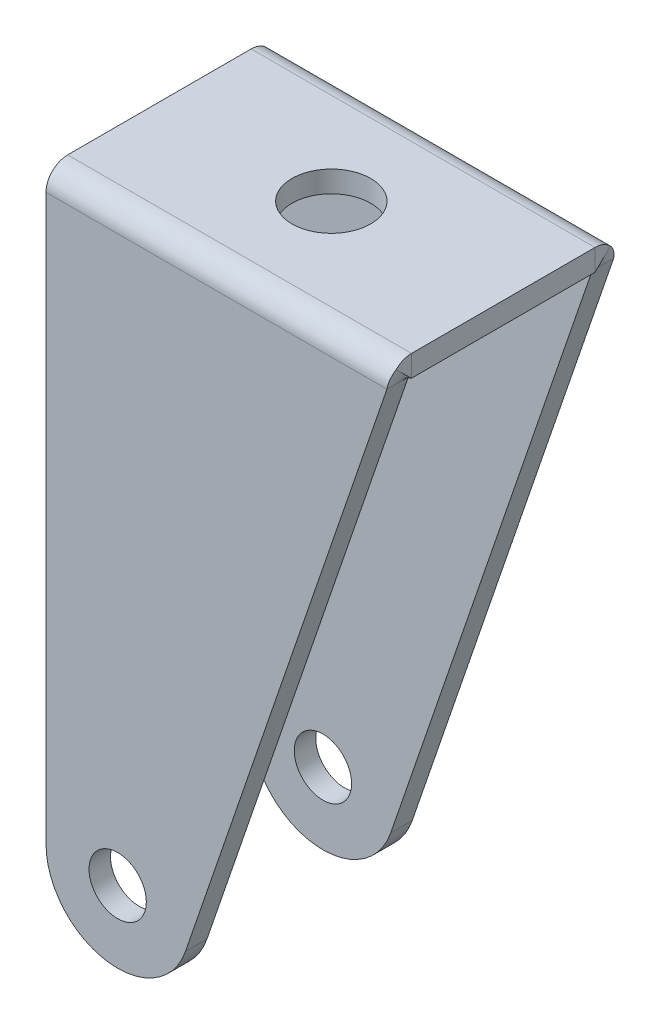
ISO-10303-21;
HEADER;
FILE_DESCRIPTION(('STEP AP214'),'2;1');
FILE_NAME('part.step','',(''),(''),'','','');
FILE_SCHEMA(('AUTOMOTIVE_DESIGN { 1 0 10303 214 1 1 1 1 }'));
ENDSEC;
DATA;
#1=APPLICATION_CONTEXT('core data for automotive mechanical design processes');
#2=APPLICATION_PROTOCOL_DEFINITION('international standard','automotive_design',2000,#1);
#3=PRODUCT_CONTEXT('',#1,'mechanical');
#4=PRODUCT('Part','Part','',(#3));
#5=PRODUCT_RELATED_PRODUCT_CATEGORY('part','',(#4));
#6=PRODUCT_DEFINITION_FORMATION('','',#4);
#7=PRODUCT_DEFINITION_CONTEXT('part definition',#1,'design');
#8=PRODUCT_DEFINITION('design','',#6,#7);
#9=PRODUCT_DEFINITION_SHAPE('','',#8);
#10=(LENGTH_UNIT() NAMED_UNIT(*) SI_UNIT(.MILLI.,.METRE.));
#11=(NAMED_UNIT(*) PLANE_ANGLE_UNIT() SI_UNIT($,.RADIAN.));
#12=(NAMED_UNIT(*) SI_UNIT($,.STERADIAN.) SOLID_ANGLE_UNIT());
#13=UNCERTAINTY_MEASURE_WITH_UNIT(LENGTH_MEASURE(1.E-05),#10,'distance_accuracy_value','');
#14=(GEOMETRIC_REPRESENTATION_CONTEXT(3) GLOBAL_UNCERTAINTY_ASSIGNED_CONTEXT((#13)) GLOBAL_UNIT_ASSIGNED_CONTEXT((#10,
#11,#12)) REPRESENTATION_CONTEXT('',''));
#15=CARTESIAN_POINT('',(0.,0.,0.));
#16=DIRECTION('',(0.,0.,1.));
#17=DIRECTION('',(1.,0.,0.));
#18=AXIS2_PLACEMENT_3D('',#15,#16,#17);
#19=CARTESIAN_POINT('',(5.,1.5,-48.0002960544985));
#20=DIRECTION('',(0.,1.,0.));
#21=DIRECTION('',(0.,0.,1.));
#22=AXIS2_PLACEMENT_3D('',#19,#20,#21);
#23=PLANE('',#22);
#24=CARTESIAN_POINT('',(12.,1.5,-1.));
#25=DIRECTION('',(0.,1.,0.));
#26=DIRECTION('',(0.,0.,1.));
#27=AXIS2_PLACEMENT_3D('',#24,#25,#26);
#28=CIRCLE('',#27,2.75);
#29=CARTESIAN_POINT('',(12.,1.5,1.75));
#30=VERTEX_POINT('',#29);
#31=EDGE_CURVE('E370',#30,#30,#28,.T.);
#32=ORIENTED_EDGE('',*,*,#31,.F.);
#33=EDGE_LOOP('',(#32));
#34=FACE_BOUND('',#33,.T.);
#35=DIRECTION('',(0.,0.,1.));
#36=VECTOR('',#35,1.);
#37=CARTESIAN_POINT('',(0.,1.5,-48.0002960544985));
#38=LINE('',#37,#36);
#39=CARTESIAN_POINT('',(0.,1.5,-7.40314292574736));
#40=VERTEX_POINT('',#39);
#41=CARTESIAN_POINT('',(0.,1.5,5.40305186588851));
#42=VERTEX_POINT('',#41);
#43=EDGE_CURVE('E364',#40,#42,#38,.T.);
#44=ORIENTED_EDGE('',*,*,#43,.T.);
#45=DIRECTION('',(1.,0.,0.));
#46=VECTOR('',#45,1.);
#47=CARTESIAN_POINT('',(5.,1.5,5.40305186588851));
#48=LINE('',#47,#46);
#49=CARTESIAN_POINT('',(23.9990036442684,1.5,5.40305186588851));
#50=VERTEX_POINT('',#49);
#51=EDGE_CURVE('E354',#42,#50,#48,.T.);
#52=ORIENTED_EDGE('',*,*,#51,.T.);
#53=DIRECTION('',(0.,0.,-1.));
#54=VECTOR('',#53,1.);
#55=CARTESIAN_POINT('',(23.9990036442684,1.5,-8.00004552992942));
#56=LINE('',#55,#54);
#57=CARTESIAN_POINT('',(23.9990036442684,1.5,-7.40314292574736));
#58=VERTEX_POINT('',#57);
#59=EDGE_CURVE('E365',#50,#58,#56,.T.);
#60=ORIENTED_EDGE('',*,*,#59,.T.);
#61=DIRECTION('',(1.,0.,0.));
#62=VECTOR('',#61,1.);
#63=CARTESIAN_POINT('',(5.,1.5,-7.40314292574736));
#64=LINE('',#63,#62);
#65=EDGE_CURVE('E368',#40,#58,#64,.T.);
#66=ORIENTED_EDGE('',*,*,#65,.F.);
#67=EDGE_LOOP('',(#44,#52,#60,#66));
#68=FACE_BOUND('',#67,.T.);
#69=ADVANCED_FACE('F54',(#34,#68),#23,.T.);
#70=CARTESIAN_POINT('',(23.9990036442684,1.5,-8.00004552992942));
#71=DIRECTION('',(-1.,0.,0.));
#72=DIRECTION('',(0.,0.,1.));
#73=AXIS2_PLACEMENT_3D('',#70,#71,#72);
#74=PLANE('',#73);
#75=DIRECTION('',(0.,1.,0.));
#76=VECTOR('',#75,1.);
#77=CARTESIAN_POINT('',(23.9990036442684,1.5,5.40305186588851));
#78=LINE('',#77,#76);
#79=CARTESIAN_POINT('',(23.9990036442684,0.,5.40305186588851));
#80=VERTEX_POINT('',#79);
#81=EDGE_CURVE('E12',#80,#50,#78,.T.);
#82=ORIENTED_EDGE('',*,*,#81,.F.);
#83=DIRECTION('',(0.,0.,-1.));
#84=VECTOR('',#83,1.);
#85=CARTESIAN_POINT('',(23.9990036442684,0.,-8.00004552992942));
#86=LINE('',#85,#84);
#87=CARTESIAN_POINT('',(23.9990036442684,0.,-7.40314292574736));
#88=VERTEX_POINT('',#87);
#89=EDGE_CURVE('E73',#80,#88,#86,.T.);
#90=ORIENTED_EDGE('',*,*,#89,.T.);
#91=DIRECTION('',(0.,1.,0.));
#92=VECTOR('',#91,1.);
#93=CARTESIAN_POINT('',(23.9990036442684,1.5,-7.40314292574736));
#94=LINE('',#93,#92);
#95=EDGE_CURVE('E439',#88,#58,#94,.T.);
#96=ORIENTED_EDGE('',*,*,#95,.T.);
#97=ORIENTED_EDGE('',*,*,#59,.F.);
#98=EDGE_LOOP('',(#82,#90,#96,#97));
#99=FACE_BOUND('',#98,.T.);
#100=ADVANCED_FACE('F415',(#99),#74,.F.);
#101=CARTESIAN_POINT('',(0.,1.5,-48.0002960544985));
#102=DIRECTION('',(1.,0.,0.));
#103=DIRECTION('',(0.,0.,-1.));
#104=AXIS2_PLACEMENT_3D('',#101,#102,#103);
#105=PLANE('',#104);
#106=DIRECTION('',(0.,-1.,0.));
#107=VECTOR('',#106,1.);
#108=CARTESIAN_POINT('',(0.,1.5,5.40305186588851));
#109=LINE('',#108,#107);
#110=CARTESIAN_POINT('',(0.,0.,5.40305186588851));
#111=VERTEX_POINT('',#110);
#112=EDGE_CURVE('E357',#42,#111,#109,.T.);
#113=ORIENTED_EDGE('',*,*,#112,.F.);
#114=ORIENTED_EDGE('',*,*,#43,.F.);
#115=DIRECTION('',(0.,-1.,0.));
#116=VECTOR('',#115,1.);
#117=CARTESIAN_POINT('',(0.,1.5,-7.40314292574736));
#118=LINE('',#117,#116);
#119=CARTESIAN_POINT('',(0.,0.,-7.40314292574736));
#120=VERTEX_POINT('',#119);
#121=EDGE_CURVE('E358',#40,#120,#118,.T.);
#122=ORIENTED_EDGE('',*,*,#121,.T.);
#123=DIRECTION('',(0.,0.,1.));
#124=VECTOR('',#123,1.);
#125=CARTESIAN_POINT('',(0.,0.,-48.0002960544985));
#126=LINE('',#125,#124);
#127=EDGE_CURVE('E81',#120,#111,#126,.T.);
#128=ORIENTED_EDGE('',*,*,#127,.T.);
#129=EDGE_LOOP('',(#113,#114,#122,#128));
#130=FACE_BOUND('',#129,.T.);
#131=ADVANCED_FACE('F421',(#130),#105,.F.);
#132=CARTESIAN_POINT('',(5.,0.,-48.0002960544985));
#133=DIRECTION('',(0.,1.,0.));
#134=DIRECTION('',(0.,0.,1.));
#135=AXIS2_PLACEMENT_3D('',#132,#133,#134);
#136=PLANE('',#135);
#137=DIRECTION('',(1.,0.,0.));
#138=VECTOR('',#137,1.);
#139=CARTESIAN_POINT('',(5.,0.,5.40305186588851));
#140=LINE('',#139,#138);
#141=EDGE_CURVE('E65',#111,#80,#140,.T.);
#142=ORIENTED_EDGE('',*,*,#141,.F.);
#143=ORIENTED_EDGE('',*,*,#127,.F.);
#144=DIRECTION('',(1.,0.,0.));
#145=VECTOR('',#144,1.);
#146=CARTESIAN_POINT('',(5.,0.,-7.40314292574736));
#147=LINE('',#146,#145);
#148=EDGE_CURVE('E441',#120,#88,#147,.T.);
#149=ORIENTED_EDGE('',*,*,#148,.T.);
#150=ORIENTED_EDGE('',*,*,#89,.F.);
#151=EDGE_LOOP('',(#142,#143,#149,#150));
#152=FACE_BOUND('',#151,.T.);
#153=CARTESIAN_POINT('',(12.,0.,-1.));
#154=DIRECTION('',(0.,1.,0.));
#155=DIRECTION('',(0.,0.,1.));
#156=AXIS2_PLACEMENT_3D('',#153,#154,#155);
#157=CIRCLE('',#156,2.75);
#158=CARTESIAN_POINT('',(12.,0.,1.75));
#159=VERTEX_POINT('',#158);
#160=EDGE_CURVE('E444',#159,#159,#157,.T.);
#161=ORIENTED_EDGE('',*,*,#160,.T.);
#162=EDGE_LOOP('',(#161));
#163=FACE_BOUND('',#162,.T.);
#164=ADVANCED_FACE('F56',(#152,#163),#136,.F.);
#165=CARTESIAN_POINT('',(12.,1.5,-1.));
#166=DIRECTION('',(0.,-1.,0.));
#167=DIRECTION('',(0.,0.,-1.));
#168=AXIS2_PLACEMENT_3D('',#165,#166,#167);
#169=CYLINDRICAL_SURFACE('',#168,2.75);
#170=ORIENTED_EDGE('',*,*,#31,.T.);
#171=EDGE_LOOP('',(#170));
#172=FACE_BOUND('',#171,.T.);
#173=ORIENTED_EDGE('',*,*,#160,.F.);
#174=EDGE_LOOP('',(#173));
#175=FACE_BOUND('',#174,.T.);
#176=ADVANCED_FACE('F431',(#172,#175),#169,.F.);
#177=CARTESIAN_POINT('',(0.,-0.01,-7.40314292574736));
#178=DIRECTION('',(-1.,0.,0.));
#179=DIRECTION('',(0.,0.,1.));
#180=AXIS2_PLACEMENT_3D('',#177,#178,#179);
#181=PLANE('',#180);
#182=DIRECTION('',(0.,0.,1.));
#183=VECTOR('',#182,1.);
#184=CARTESIAN_POINT('',(0.,-0.0100000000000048,-8.91314292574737));
#185=LINE('',#184,#183);
#186=CARTESIAN_POINT('',(0.,-0.010000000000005,-8.91314292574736));
#187=VERTEX_POINT('',#186);
#188=CARTESIAN_POINT('',(0.,-0.00999999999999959,-7.41314292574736));
#189=VERTEX_POINT('',#188);
#190=EDGE_CURVE('E345',#187,#189,#185,.T.);
#191=ORIENTED_EDGE('',*,*,#190,.T.);
#192=CARTESIAN_POINT('',(0.,-0.01,-7.40314292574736));
#193=DIRECTION('',(-1.,0.,0.));
#194=DIRECTION('',(0.,0.,1.));
#195=AXIS2_PLACEMENT_3D('',#192,#193,#194);
#196=CIRCLE('',#195,0.01);
#197=EDGE_CURVE('E482',#189,#120,#196,.F.);
#198=ORIENTED_EDGE('',*,*,#197,.T.);
#199=ORIENTED_EDGE('',*,*,#121,.F.);
#200=CARTESIAN_POINT('',(0.,-0.01,-7.40314292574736));
#201=DIRECTION('',(1.,0.,0.));
#202=DIRECTION('',(0.,0.,-1.));
#203=AXIS2_PLACEMENT_3D('',#200,#201,#202);
#204=CIRCLE('',#203,1.51);
#205=EDGE_CURVE('E478',#187,#40,#204,.T.);
#206=ORIENTED_EDGE('',*,*,#205,.F.);
#207=EDGE_LOOP('',(#191,#198,#199,#206));
#208=FACE_BOUND('',#207,.T.);
#209=ADVANCED_FACE('F545',(#208),#181,.T.);
#210=CARTESIAN_POINT('',(23.9990036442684,-0.01,-7.40314292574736));
#211=DIRECTION('',(1.,0.,0.));
#212=DIRECTION('',(0.,0.,-1.));
#213=AXIS2_PLACEMENT_3D('',#210,#211,#212);
#214=PLANE('',#213);
#215=ORIENTED_EDGE('',*,*,#95,.F.);
#216=CARTESIAN_POINT('',(23.9990036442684,-0.01,-7.40314292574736));
#217=DIRECTION('',(-1.,0.,0.));
#218=DIRECTION('',(0.,0.,1.));
#219=AXIS2_PLACEMENT_3D('',#216,#217,#218);
#220=CIRCLE('',#219,0.01);
#221=CARTESIAN_POINT('',(23.9990036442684,-0.00292893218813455,-7.41021399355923));
#222=VERTEX_POINT('',#221);
#223=EDGE_CURVE('E484',#88,#222,#220,.T.);
#224=ORIENTED_EDGE('',*,*,#223,.T.);
#225=CARTESIAN_POINT('',(23.9990036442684,1.05773123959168,-8.47087416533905));
#226=CARTESIAN_POINT('',(23.9990036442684,-0.00292893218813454,-7.41021399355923));
#227=B_SPLINE_CURVE_WITH_KNOTS('',1,(#225,#226),.UNSPECIFIED.,.F.,.F.,(2,2),(0.,1.),.UNSPECIFIED.);
#228=CARTESIAN_POINT('',(23.9990036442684,1.05773123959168,-8.47087416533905));
#229=VERTEX_POINT('',#228);
#230=EDGE_CURVE('E569',#222,#229,#227,.F.);
#231=ORIENTED_EDGE('',*,*,#230,.T.);
#232=CARTESIAN_POINT('',(23.9990036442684,-0.01,-7.40314292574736));
#233=DIRECTION('',(-1.,0.,0.));
#234=DIRECTION('',(0.,0.,1.));
#235=AXIS2_PLACEMENT_3D('',#232,#233,#234);
#236=CIRCLE('',#235,1.51);
#237=EDGE_CURVE('E480',#58,#229,#236,.T.);
#238=ORIENTED_EDGE('',*,*,#237,.F.);
#239=EDGE_LOOP('',(#215,#224,#231,#238));
#240=FACE_BOUND('',#239,.T.);
#241=ADVANCED_FACE('F501',(#240),#214,.T.);
#242=CARTESIAN_POINT('',(23.9990036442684,1.05773123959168,-8.47087416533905));
#243=CARTESIAN_POINT('',(23.9648915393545,0.917941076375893,-8.61066432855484));
#244=CARTESIAN_POINT('',(23.9307913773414,0.750464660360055,-8.72256037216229));
#245=CARTESIAN_POINT('',(23.8625791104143,0.385239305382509,-8.87384166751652));
#246=CARTESIAN_POINT('',(23.8284789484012,0.187693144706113,-8.91314292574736));
#247=CARTESIAN_POINT('',(23.7943668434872,-0.0100000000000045,-8.91314292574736));
#248=CARTESIAN_POINT('',(23.9990036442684,-0.00292893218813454,-7.41021399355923));
#249=CARTESIAN_POINT('',(23.9648975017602,-0.00385453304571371,-7.41113959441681));
#250=CARTESIAN_POINT('',(23.9307913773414,-0.00496381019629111,-7.4118807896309));
#251=CARTESIAN_POINT('',(23.8625791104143,-0.00738252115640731,-7.41288265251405));
#252=CARTESIAN_POINT('',(23.8284729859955,-0.00869100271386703,-7.41314292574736));
#253=CARTESIAN_POINT('',(23.7943668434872,-0.0100000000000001,-7.41314292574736));
#254=B_SPLINE_SURFACE_WITH_KNOTS('',1,3,((#242,#243,#244,#245,#246,#247),(#248,#249,#250,#251,
#252,#253)),.UNSPECIFIED.,.F.,.F.,.F.,(2,2),(4,2,4),(0.,1.),(0.,0.5,1.),.UNSPECIFIED.);
#255=CARTESIAN_POINT('',(23.9990036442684,-0.00292893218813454,-7.41021399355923));
#256=CARTESIAN_POINT('',(23.9648975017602,-0.00385453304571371,-7.41113959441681));
#257=CARTESIAN_POINT('',(23.9307913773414,-0.00496381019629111,-7.4118807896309));
#258=CARTESIAN_POINT('',(23.8625791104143,-0.00738252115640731,-7.41288265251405));
#259=CARTESIAN_POINT('',(23.8284729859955,-0.00869100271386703,-7.41314292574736));
#260=CARTESIAN_POINT('',(23.7943668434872,-0.0100000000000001,-7.41314292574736));
#261=B_SPLINE_CURVE_WITH_KNOTS('',3,(#255,#256,#257,#258,#259,#260),.UNSPECIFIED.,.F.,.F.,(4,2,
4),(0.,0.5,1.),.UNSPECIFIED.);
#262=CARTESIAN_POINT('',(23.7943668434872,-0.00999999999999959,-7.41314292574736));
#263=VERTEX_POINT('',#262);
#264=EDGE_CURVE('E481',#222,#263,#261,.T.);
#265=CARTESIAN_POINT('',(23.7943668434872,-0.0100000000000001,-7.41314292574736));
#266=CARTESIAN_POINT('',(23.7943668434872,-0.0100000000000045,-8.91314292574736));
#267=B_SPLINE_CURVE_WITH_KNOTS('',1,(#265,#266),.UNSPECIFIED.,.F.,.F.,(2,2),(0.,1.),.UNSPECIFIED.);
#268=CARTESIAN_POINT('',(23.7943668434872,-0.0100000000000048,-8.91314292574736));
#269=VERTEX_POINT('',#268);
#270=EDGE_CURVE('E344',#263,#269,#267,.T.);
#271=CARTESIAN_POINT('',(23.7943668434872,-0.0100000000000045,-8.91314292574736));
#272=CARTESIAN_POINT('',(23.8284789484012,0.187693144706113,-8.91314292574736));
#273=CARTESIAN_POINT('',(23.8625791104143,0.385239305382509,-8.87384166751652));
#274=CARTESIAN_POINT('',(23.9307913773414,0.750464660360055,-8.72256037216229));
#275=CARTESIAN_POINT('',(23.9648915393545,0.917941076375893,-8.61066432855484));
#276=CARTESIAN_POINT('',(23.9990036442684,1.05773123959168,-8.47087416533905));
#277=B_SPLINE_CURVE_WITH_KNOTS('',3,(#271,#272,#273,#274,#275,#276),.UNSPECIFIED.,.F.,.F.,(4,2,
4),(0.,0.5,1.),.UNSPECIFIED.);
#278=EDGE_CURVE('E529',#229,#269,#277,.F.);
#279=ORIENTED_EDGE('',*,*,#264,.T.);
#280=ORIENTED_EDGE('',*,*,#270,.T.);
#281=ORIENTED_EDGE('',*,*,#278,.F.);
#282=ORIENTED_EDGE('',*,*,#230,.F.);
#283=EDGE_LOOP('',(#279,#280,#281,#282));
#284=FACE_BOUND('',#283,.T.);
#285=ADVANCED_FACE('F500',(#284),#254,.T.);
#286=CARTESIAN_POINT('',(36.0749529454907,-0.01,-7.40314292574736));
#287=DIRECTION('',(-1.,0.,0.));
#288=DIRECTION('',(0.,0.,1.));
#289=AXIS2_PLACEMENT_3D('',#286,#287,#288);
#290=CYLINDRICAL_SURFACE('',#289,1.51);
#291=ORIENTED_EDGE('',*,*,#237,.T.);
#292=ORIENTED_EDGE('',*,*,#278,.T.);
#293=DIRECTION('',(1.,0.,0.));
#294=VECTOR('',#293,1.);
#295=CARTESIAN_POINT('',(5.,-0.0100000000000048,-8.91314292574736));
#296=LINE('',#295,#294);
#297=EDGE_CURVE('E449',#187,#269,#296,.T.);
#298=ORIENTED_EDGE('',*,*,#297,.F.);
#299=ORIENTED_EDGE('',*,*,#205,.T.);
#300=ORIENTED_EDGE('',*,*,#65,.T.);
#301=EDGE_LOOP('',(#291,#292,#298,#299,#300));
#302=FACE_BOUND('',#301,.T.);
#303=ADVANCED_FACE('F491',(#302),#290,.T.);
#304=CARTESIAN_POINT('',(36.0749529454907,-0.01,-7.40314292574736));
#305=DIRECTION('',(-1.,0.,0.));
#306=DIRECTION('',(0.,0.,1.));
#307=AXIS2_PLACEMENT_3D('',#304,#305,#306);
#308=CYLINDRICAL_SURFACE('',#307,0.01);
#309=ORIENTED_EDGE('',*,*,#223,.F.);
#310=ORIENTED_EDGE('',*,*,#148,.F.);
#311=ORIENTED_EDGE('',*,*,#197,.F.);
#312=DIRECTION('',(1.,0.,0.));
#313=VECTOR('',#312,1.);
#314=CARTESIAN_POINT('',(5.,-0.00999999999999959,-7.41314292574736));
#315=LINE('',#314,#313);
#316=EDGE_CURVE('E336',#189,#263,#315,.T.);
#317=ORIENTED_EDGE('',*,*,#316,.T.);
#318=ORIENTED_EDGE('',*,*,#264,.F.);
#319=EDGE_LOOP('',(#309,#310,#311,#317,#318));
#320=FACE_BOUND('',#319,.T.);
#321=ADVANCED_FACE('F313',(#320),#308,.F.);
#322=CARTESIAN_POINT('',(5.,-39.413347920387,-8.91314292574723));
#323=DIRECTION('',(0.,0.,1.));
#324=DIRECTION('',(0.,-1.,0.));
#325=AXIS2_PLACEMENT_3D('',#322,#323,#324);
#326=CYLINDRICAL_SURFACE('',#325,5.);
#327=CARTESIAN_POINT('',(5.,-39.413347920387,-7.41314292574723));
#328=DIRECTION('',(0.,0.,-1.));
#329=DIRECTION('',(0.,1.,0.));
#330=AXIS2_PLACEMENT_3D('',#327,#328,#329);
#331=CIRCLE('',#330,5.);
#332=CARTESIAN_POINT('',(9.72976745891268,-41.0348594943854,-7.41314292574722));
#333=VERTEX_POINT('',#332);
#334=CARTESIAN_POINT('',(0.,-39.413347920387,-7.41314292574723));
#335=VERTEX_POINT('',#334);
#336=EDGE_CURVE('E473',#333,#335,#331,.T.);
#337=ORIENTED_EDGE('',*,*,#336,.T.);
#338=DIRECTION('',(0.,0.,1.));
#339=VECTOR('',#338,1.);
#340=CARTESIAN_POINT('',(0.,-39.413347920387,-8.91314292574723));
#341=LINE('',#340,#339);
#342=CARTESIAN_POINT('',(0.,-39.413347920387,-8.91314292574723));
#343=VERTEX_POINT('',#342);
#344=EDGE_CURVE('E605',#343,#335,#341,.T.);
#345=ORIENTED_EDGE('',*,*,#344,.F.);
#346=CARTESIAN_POINT('',(5.,-39.413347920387,-8.91314292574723));
#347=DIRECTION('',(0.,0.,-1.));
#348=DIRECTION('',(0.,1.,0.));
#349=AXIS2_PLACEMENT_3D('',#346,#347,#348);
#350=CIRCLE('',#349,5.);
#351=CARTESIAN_POINT('',(9.72976745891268,-41.0348594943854,-8.91314292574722));
#352=VERTEX_POINT('',#351);
#353=EDGE_CURVE('E351',#352,#343,#350,.T.);
#354=ORIENTED_EDGE('',*,*,#353,.F.);
#355=DIRECTION('',(0.,0.,1.));
#356=VECTOR('',#355,1.);
#357=CARTESIAN_POINT('',(9.72976745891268,-41.0348594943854,-8.91314292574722));
#358=LINE('',#357,#356);
#359=EDGE_CURVE('E470',#352,#333,#358,.T.);
#360=ORIENTED_EDGE('',*,*,#359,.T.);
#361=EDGE_LOOP('',(#337,#345,#354,#360));
#362=FACE_BOUND('',#361,.T.);
#363=ADVANCED_FACE('F309',(#362),#326,.T.);
#364=CARTESIAN_POINT('',(5.,-39.413347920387,-8.91314292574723));
#365=DIRECTION('',(0.,0.,1.));
#366=DIRECTION('',(0.,-1.,0.));
#367=AXIS2_PLACEMENT_3D('',#364,#365,#366);
#368=CYLINDRICAL_SURFACE('',#367,2.);
#369=CARTESIAN_POINT('',(5.,-39.413347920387,-8.91314292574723));
#370=DIRECTION('',(0.,0.,-1.));
#371=DIRECTION('',(0.,1.,0.));
#372=AXIS2_PLACEMENT_3D('',#369,#370,#371);
#373=CIRCLE('',#372,2.);
#374=CARTESIAN_POINT('',(5.,-37.413347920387,-8.91314292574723));
#375=VERTEX_POINT('',#374);
#376=EDGE_CURVE('E467',#375,#375,#373,.T.);
#377=ORIENTED_EDGE('',*,*,#376,.T.);
#378=EDGE_LOOP('',(#377));
#379=FACE_BOUND('',#378,.T.);
#380=CARTESIAN_POINT('',(5.,-39.413347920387,-7.41314292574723));
#381=DIRECTION('',(0.,0.,-1.));
#382=DIRECTION('',(0.,1.,0.));
#383=AXIS2_PLACEMENT_3D('',#380,#381,#382);
#384=CIRCLE('',#383,2.);
#385=CARTESIAN_POINT('',(5.,-37.413347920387,-7.41314292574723));
#386=VERTEX_POINT('',#385);
#387=EDGE_CURVE('E350',#386,#386,#384,.T.);
#388=ORIENTED_EDGE('',*,*,#387,.F.);
#389=EDGE_LOOP('',(#388));
#390=FACE_BOUND('',#389,.T.);
#391=ADVANCED_FACE('F312',(#379,#390),#368,.F.);
#392=CARTESIAN_POINT('',(5.,-39.413347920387,-8.91314292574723));
#393=DIRECTION('',(0.,0.,-1.));
#394=DIRECTION('',(0.,1.,0.));
#395=AXIS2_PLACEMENT_3D('',#392,#393,#394);
#396=PLANE('',#395);
#397=ORIENTED_EDGE('',*,*,#376,.F.);
#398=EDGE_LOOP('',(#397));
#399=FACE_BOUND('',#398,.T.);
#400=DIRECTION('',(0.,1.,0.));
#401=VECTOR('',#400,1.);
#402=CARTESIAN_POINT('',(0.,-39.413347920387,-8.91314292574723));
#403=LINE('',#402,#401);
#404=EDGE_CURVE('E452',#343,#187,#403,.T.);
#405=ORIENTED_EDGE('',*,*,#404,.T.);
#406=ORIENTED_EDGE('',*,*,#297,.T.);
#407=DIRECTION('',(-0.324302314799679,-0.945953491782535,0.));
#408=VECTOR('',#407,1.);
#409=CARTESIAN_POINT('',(23.9990036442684,0.586902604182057,-8.91314292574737));
#410=LINE('',#409,#408);
#411=EDGE_CURVE('E451',#269,#352,#410,.T.);
#412=ORIENTED_EDGE('',*,*,#411,.T.);
#413=ORIENTED_EDGE('',*,*,#353,.T.);
#414=EDGE_LOOP('',(#405,#406,#412,#413));
#415=FACE_BOUND('',#414,.T.);
#416=ADVANCED_FACE('F317',(#399,#415),#396,.T.);
#417=CARTESIAN_POINT('',(23.9990036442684,0.586902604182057,-8.91314292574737));
#418=DIRECTION('',(-0.945953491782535,0.324302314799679,0.));
#419=DIRECTION('',(0.324302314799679,0.945953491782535,0.));
#420=AXIS2_PLACEMENT_3D('',#417,#418,#419);
#421=PLANE('',#420);
#422=ORIENTED_EDGE('',*,*,#270,.F.);
#423=DIRECTION('',(-0.324302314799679,-0.945953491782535,0.));
#424=VECTOR('',#423,1.);
#425=CARTESIAN_POINT('',(23.9990036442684,0.586902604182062,-7.41314292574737));
#426=LINE('',#425,#424);
#427=EDGE_CURVE('E348',#263,#333,#426,.T.);
#428=ORIENTED_EDGE('',*,*,#427,.T.);
#429=ORIENTED_EDGE('',*,*,#359,.F.);
#430=ORIENTED_EDGE('',*,*,#411,.F.);
#431=EDGE_LOOP('',(#422,#428,#429,#430));
#432=FACE_BOUND('',#431,.T.);
#433=ADVANCED_FACE('F321',(#432),#421,.F.);
#434=CARTESIAN_POINT('',(5.,-39.413347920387,-7.41314292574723));
#435=DIRECTION('',(0.,0.,-1.));
#436=DIRECTION('',(0.,1.,0.));
#437=AXIS2_PLACEMENT_3D('',#434,#435,#436);
#438=PLANE('',#437);
#439=ORIENTED_EDGE('',*,*,#316,.F.);
#440=DIRECTION('',(0.,1.,0.));
#441=VECTOR('',#440,1.);
#442=CARTESIAN_POINT('',(0.,-39.413347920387,-7.41314292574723));
#443=LINE('',#442,#441);
#444=EDGE_CURVE('E298',#335,#189,#443,.T.);
#445=ORIENTED_EDGE('',*,*,#444,.F.);
#446=ORIENTED_EDGE('',*,*,#336,.F.);
#447=ORIENTED_EDGE('',*,*,#427,.F.);
#448=EDGE_LOOP('',(#439,#445,#446,#447));
#449=FACE_BOUND('',#448,.T.);
#450=ORIENTED_EDGE('',*,*,#387,.T.);
#451=EDGE_LOOP('',(#450));
#452=FACE_BOUND('',#451,.T.);
#453=ADVANCED_FACE('F326',(#449,#452),#438,.F.);
#454=CARTESIAN_POINT('',(0.,-39.413347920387,-8.91314292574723));
#455=DIRECTION('',(1.,0.,0.));
#456=DIRECTION('',(0.,-1.,0.));
#457=AXIS2_PLACEMENT_3D('',#454,#455,#456);
#458=PLANE('',#457);
#459=ORIENTED_EDGE('',*,*,#190,.F.);
#460=ORIENTED_EDGE('',*,*,#404,.F.);
#461=ORIENTED_EDGE('',*,*,#344,.T.);
#462=ORIENTED_EDGE('',*,*,#444,.T.);
#463=EDGE_LOOP('',(#459,#460,#461,#462));
#464=FACE_BOUND('',#463,.T.);
#465=ADVANCED_FACE('F502',(#464),#458,.F.);
#466=CARTESIAN_POINT('',(0.,-0.01,5.40305186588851));
#467=DIRECTION('',(-1.,0.,0.));
#468=DIRECTION('',(0.,0.,1.));
#469=AXIS2_PLACEMENT_3D('',#466,#467,#468);
#470=PLANE('',#469);
#471=ORIENTED_EDGE('',*,*,#112,.T.);
#472=CARTESIAN_POINT('',(0.,-0.01,5.40305186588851));
#473=DIRECTION('',(1.,0.,0.));
#474=DIRECTION('',(0.,0.,-1.));
#475=AXIS2_PLACEMENT_3D('',#472,#473,#474);
#476=CIRCLE('',#475,0.01);
#477=CARTESIAN_POINT('',(0.,-0.0100000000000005,5.41305186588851));
#478=VERTEX_POINT('',#477);
#479=EDGE_CURVE('E203',#111,#478,#476,.T.);
#480=ORIENTED_EDGE('',*,*,#479,.T.);
#481=DIRECTION('',(0.,0.,-1.));
#482=VECTOR('',#481,1.);
#483=CARTESIAN_POINT('',(0.,-0.0100000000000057,6.91305186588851));
#484=LINE('',#483,#482);
#485=CARTESIAN_POINT('',(0.,-0.0100000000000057,6.91305186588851));
#486=VERTEX_POINT('',#485);
#487=EDGE_CURVE('E169',#486,#478,#484,.T.);
#488=ORIENTED_EDGE('',*,*,#487,.F.);
#489=CARTESIAN_POINT('',(0.,-0.01,5.40305186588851));
#490=DIRECTION('',(1.,0.,0.));
#491=DIRECTION('',(0.,0.,-1.));
#492=AXIS2_PLACEMENT_3D('',#489,#490,#491);
#493=CIRCLE('',#492,1.51);
#494=EDGE_CURVE('E194',#42,#486,#493,.T.);
#495=ORIENTED_EDGE('',*,*,#494,.F.);
#496=EDGE_LOOP('',(#471,#480,#488,#495));
#497=FACE_BOUND('',#496,.T.);
#498=ADVANCED_FACE('F308',(#497),#470,.T.);
#499=CARTESIAN_POINT('',(23.7943658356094,-0.0100000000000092,6.91305186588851));
#500=CARTESIAN_POINT('',(23.8284781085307,0.187693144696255,6.91305186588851));
#501=CARTESIAN_POINT('',(23.8625784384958,0.385239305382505,6.87375060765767));
#502=CARTESIAN_POINT('',(23.9307910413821,0.750464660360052,6.72246931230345));
#503=CARTESIAN_POINT('',(23.9648913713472,0.917941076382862,6.61057326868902));
#504=CARTESIAN_POINT('',(23.9990036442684,1.05773123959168,6.4707831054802));
#505=CARTESIAN_POINT('',(23.7943658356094,-0.0100000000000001,5.41305186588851));
#506=CARTESIAN_POINT('',(23.8284721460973,-0.00869100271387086,5.41305186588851));
#507=CARTESIAN_POINT('',(23.8625784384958,-0.00738252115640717,5.4127915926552));
#508=CARTESIAN_POINT('',(23.9307910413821,-0.00496381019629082,5.41178972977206));
#509=CARTESIAN_POINT('',(23.9648973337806,-0.00385453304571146,5.41104853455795));
#510=CARTESIAN_POINT('',(23.9990036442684,-0.00292893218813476,5.41012293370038));
#511=B_SPLINE_SURFACE_WITH_KNOTS('',1,3,((#499,#500,#501,#502,#503,#504),(#505,#506,#507,#508,
#509,#510)),.UNSPECIFIED.,.F.,.F.,.F.,(2,2),(4,2,4),(0.,1.),(0.,0.5,1.),.UNSPECIFIED.);
#512=CARTESIAN_POINT('',(23.7943658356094,-0.0100000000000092,6.91305186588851));
#513=CARTESIAN_POINT('',(23.7943658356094,-0.0100000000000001,5.41305186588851));
#514=B_SPLINE_CURVE_WITH_KNOTS('',1,(#512,#513),.UNSPECIFIED.,.F.,.F.,(2,2),(0.,1.),.UNSPECIFIED.);
#515=CARTESIAN_POINT('',(23.7943658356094,-0.0100000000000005,5.41305186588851));
#516=VERTEX_POINT('',#515);
#517=CARTESIAN_POINT('',(23.7943658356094,-0.0100000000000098,6.91305186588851));
#518=VERTEX_POINT('',#517);
#519=EDGE_CURVE('E272',#516,#518,#514,.F.);
#520=CARTESIAN_POINT('',(23.7943658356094,-0.0100000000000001,5.41305186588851));
#521=CARTESIAN_POINT('',(23.8284721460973,-0.00869100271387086,5.41305186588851));
#522=CARTESIAN_POINT('',(23.8625784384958,-0.00738252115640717,5.4127915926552));
#523=CARTESIAN_POINT('',(23.9307910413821,-0.00496381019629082,5.41178972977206));
#524=CARTESIAN_POINT('',(23.9648973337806,-0.00385453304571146,5.41104853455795));
#525=CARTESIAN_POINT('',(23.9990036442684,-0.00292893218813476,5.41012293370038));
#526=B_SPLINE_CURVE_WITH_KNOTS('',3,(#520,#521,#522,#523,#524,#525),.UNSPECIFIED.,.F.,.F.,(4,2,
4),(0.,0.5,1.),.UNSPECIFIED.);
#527=CARTESIAN_POINT('',(23.9990036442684,-0.00292893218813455,5.41012293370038));
#528=VERTEX_POINT('',#527);
#529=EDGE_CURVE('E244',#516,#528,#526,.T.);
#530=CARTESIAN_POINT('',(23.9990036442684,-0.00292893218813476,5.41012293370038));
#531=CARTESIAN_POINT('',(23.9990036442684,1.05773123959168,6.4707831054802));
#532=B_SPLINE_CURVE_WITH_KNOTS('',1,(#530,#531),.UNSPECIFIED.,.F.,.F.,(2,2),(0.,1.),.UNSPECIFIED.);
#533=CARTESIAN_POINT('',(23.9990036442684,1.05773123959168,6.4707831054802));
#534=VERTEX_POINT('',#533);
#535=EDGE_CURVE('E282',#528,#534,#532,.T.);
#536=CARTESIAN_POINT('',(23.9990036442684,1.05773123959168,6.4707831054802));
#537=CARTESIAN_POINT('',(23.9648913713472,0.917941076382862,6.61057326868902));
#538=CARTESIAN_POINT('',(23.9307910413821,0.750464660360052,6.72246931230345));
#539=CARTESIAN_POINT('',(23.8625784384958,0.385239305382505,6.87375060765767));
#540=CARTESIAN_POINT('',(23.8284781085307,0.187693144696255,6.91305186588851));
#541=CARTESIAN_POINT('',(23.7943658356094,-0.0100000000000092,6.91305186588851));
#542=B_SPLINE_CURVE_WITH_KNOTS('',3,(#536,#537,#538,#539,#540,#541),.UNSPECIFIED.,.F.,.F.,(4,2,
4),(0.,0.5,1.),.UNSPECIFIED.);
#543=EDGE_CURVE('E197',#518,#534,#542,.F.);
#544=ORIENTED_EDGE('',*,*,#519,.F.);
#545=ORIENTED_EDGE('',*,*,#529,.T.);
#546=ORIENTED_EDGE('',*,*,#535,.T.);
#547=ORIENTED_EDGE('',*,*,#543,.F.);
#548=EDGE_LOOP('',(#544,#545,#546,#547));
#549=FACE_BOUND('',#548,.T.);
#550=ADVANCED_FACE('F217',(#549),#511,.T.);
#551=CARTESIAN_POINT('',(23.9990036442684,-0.01,5.40305186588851));
#552=DIRECTION('',(1.,0.,0.));
#553=DIRECTION('',(0.,0.,-1.));
#554=AXIS2_PLACEMENT_3D('',#551,#552,#553);
#555=PLANE('',#554);
#556=CARTESIAN_POINT('',(23.9990036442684,-0.01,5.40305186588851));
#557=DIRECTION('',(1.,0.,0.));
#558=DIRECTION('',(0.,0.,-1.));
#559=AXIS2_PLACEMENT_3D('',#556,#557,#558);
#560=CIRCLE('',#559,0.01);
#561=EDGE_CURVE('E198',#528,#80,#560,.F.);
#562=ORIENTED_EDGE('',*,*,#561,.T.);
#563=ORIENTED_EDGE('',*,*,#81,.T.);
#564=CARTESIAN_POINT('',(23.9990036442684,-0.01,5.40305186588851));
#565=DIRECTION('',(-1.,0.,0.));
#566=DIRECTION('',(0.,0.,1.));
#567=AXIS2_PLACEMENT_3D('',#564,#565,#566);
#568=CIRCLE('',#567,1.51);
#569=EDGE_CURVE('E598',#534,#50,#568,.T.);
#570=ORIENTED_EDGE('',*,*,#569,.F.);
#571=ORIENTED_EDGE('',*,*,#535,.F.);
#572=EDGE_LOOP('',(#562,#563,#570,#571));
#573=FACE_BOUND('',#572,.T.);
#574=ADVANCED_FACE('F215',(#573),#555,.T.);
#575=CARTESIAN_POINT('',(-12.0759493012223,-0.01,5.40305186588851));
#576=DIRECTION('',(1.,0.,0.));
#577=DIRECTION('',(0.,0.,-1.));
#578=AXIS2_PLACEMENT_3D('',#575,#576,#577);
#579=CYLINDRICAL_SURFACE('',#578,1.51);
#580=ORIENTED_EDGE('',*,*,#543,.T.);
#581=ORIENTED_EDGE('',*,*,#569,.T.);
#582=ORIENTED_EDGE('',*,*,#51,.F.);
#583=ORIENTED_EDGE('',*,*,#494,.T.);
#584=DIRECTION('',(1.,0.,0.));
#585=VECTOR('',#584,1.);
#586=CARTESIAN_POINT('',(5.,-0.0100000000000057,6.91305186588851));
#587=LINE('',#586,#585);
#588=EDGE_CURVE('E190',#486,#518,#587,.T.);
#589=ORIENTED_EDGE('',*,*,#588,.T.);
#590=EDGE_LOOP('',(#580,#581,#582,#583,#589));
#591=FACE_BOUND('',#590,.T.);
#592=ADVANCED_FACE('F205',(#591),#579,.T.);
#593=CARTESIAN_POINT('',(-12.0759493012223,-0.01,5.40305186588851));
#594=DIRECTION('',(1.,0.,0.));
#595=DIRECTION('',(0.,0.,-1.));
#596=AXIS2_PLACEMENT_3D('',#593,#594,#595);
#597=CYLINDRICAL_SURFACE('',#596,0.01);
#598=ORIENTED_EDGE('',*,*,#529,.F.);
#599=DIRECTION('',(1.,0.,0.));
#600=VECTOR('',#599,1.);
#601=CARTESIAN_POINT('',(5.,-0.0100000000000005,5.41305186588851));
#602=LINE('',#601,#600);
#603=EDGE_CURVE('E382',#478,#516,#602,.T.);
#604=ORIENTED_EDGE('',*,*,#603,.F.);
#605=ORIENTED_EDGE('',*,*,#479,.F.);
#606=ORIENTED_EDGE('',*,*,#141,.T.);
#607=ORIENTED_EDGE('',*,*,#561,.F.);
#608=EDGE_LOOP('',(#598,#604,#605,#606,#607));
#609=FACE_BOUND('',#608,.T.);
#610=ADVANCED_FACE('F214',(#609),#597,.F.);
#611=CARTESIAN_POINT('',(5.,-39.4131429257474,6.91305186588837));
#612=DIRECTION('',(0.,0.,-1.));
#613=DIRECTION('',(0.,1.,0.));
#614=AXIS2_PLACEMENT_3D('',#611,#612,#613);
#615=CYLINDRICAL_SURFACE('',#614,2.);
#616=CARTESIAN_POINT('',(5.,-39.4131429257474,6.91305186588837));
#617=DIRECTION('',(0.,0.,1.));
#618=DIRECTION('',(0.,-1.,0.));
#619=AXIS2_PLACEMENT_3D('',#616,#617,#618);
#620=CIRCLE('',#619,2.);
#621=CARTESIAN_POINT('',(5.,-41.4131429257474,6.91305186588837));
#622=VERTEX_POINT('',#621);
#623=EDGE_CURVE('E187',#622,#622,#620,.T.);
#624=ORIENTED_EDGE('',*,*,#623,.T.);
#625=EDGE_LOOP('',(#624));
#626=FACE_BOUND('',#625,.T.);
#627=CARTESIAN_POINT('',(5.,-39.4131429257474,5.41305186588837));
#628=DIRECTION('',(0.,0.,1.));
#629=DIRECTION('',(0.,-1.,0.));
#630=AXIS2_PLACEMENT_3D('',#627,#628,#629);
#631=CIRCLE('',#630,2.);
#632=CARTESIAN_POINT('',(5.,-41.4131429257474,5.41305186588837));
#633=VERTEX_POINT('',#632);
#634=EDGE_CURVE('E174',#633,#633,#631,.T.);
#635=ORIENTED_EDGE('',*,*,#634,.F.);
#636=EDGE_LOOP('',(#635));
#637=FACE_BOUND('',#636,.T.);
#638=ADVANCED_FACE('F224',(#626,#637),#615,.F.);
#639=CARTESIAN_POINT('',(5.,-39.4131429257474,6.91305186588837));
#640=DIRECTION('',(0.,0.,-1.));
#641=DIRECTION('',(0.,1.,0.));
#642=AXIS2_PLACEMENT_3D('',#639,#640,#641);
#643=CYLINDRICAL_SURFACE('',#642,5.00000000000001);
#644=CARTESIAN_POINT('',(5.,-39.4131429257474,5.41305186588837));
#645=DIRECTION('',(0.,0.,1.));
#646=DIRECTION('',(0.,-1.,0.));
#647=AXIS2_PLACEMENT_3D('',#644,#645,#646);
#648=CIRCLE('',#647,5.00000000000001);
#649=CARTESIAN_POINT('',(0.,-39.4131429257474,5.41305186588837));
#650=VERTEX_POINT('',#649);
#651=CARTESIAN_POINT('',(9.72976500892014,-41.0346616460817,5.41305186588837));
#652=VERTEX_POINT('',#651);
#653=EDGE_CURVE('E179',#650,#652,#648,.T.);
#654=ORIENTED_EDGE('',*,*,#653,.T.);
#655=DIRECTION('',(0.,0.,-1.));
#656=VECTOR('',#655,1.);
#657=CARTESIAN_POINT('',(9.72976500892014,-41.0346616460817,6.91305186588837));
#658=LINE('',#657,#656);
#659=CARTESIAN_POINT('',(9.72976500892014,-41.0346616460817,6.91305186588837));
#660=VERTEX_POINT('',#659);
#661=EDGE_CURVE('E389',#660,#652,#658,.T.);
#662=ORIENTED_EDGE('',*,*,#661,.F.);
#663=CARTESIAN_POINT('',(5.,-39.4131429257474,6.91305186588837));
#664=DIRECTION('',(0.,0.,1.));
#665=DIRECTION('',(0.,-1.,0.));
#666=AXIS2_PLACEMENT_3D('',#663,#664,#665);
#667=CIRCLE('',#666,5.00000000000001);
#668=CARTESIAN_POINT('',(0.,-39.4131429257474,6.91305186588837));
#669=VERTEX_POINT('',#668);
#670=EDGE_CURVE('E181',#669,#660,#667,.T.);
#671=ORIENTED_EDGE('',*,*,#670,.F.);
#672=DIRECTION('',(0.,0.,-1.));
#673=VECTOR('',#672,1.);
#674=CARTESIAN_POINT('',(0.,-39.4131429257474,6.91305186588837));
#675=LINE('',#674,#673);
#676=EDGE_CURVE('E166',#669,#650,#675,.T.);
#677=ORIENTED_EDGE('',*,*,#676,.T.);
#678=EDGE_LOOP('',(#654,#662,#671,#677));
#679=FACE_BOUND('',#678,.T.);
#680=ADVANCED_FACE('F177',(#679),#643,.T.);
#681=CARTESIAN_POINT('',(5.,54.5871531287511,6.9130518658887));
#682=DIRECTION('',(0.,0.,1.));
#683=DIRECTION('',(0.,-1.,0.));
#684=AXIS2_PLACEMENT_3D('',#681,#682,#683);
#685=PLANE('',#684);
#686=ORIENTED_EDGE('',*,*,#588,.F.);
#687=DIRECTION('',(0.,-1.,0.));
#688=VECTOR('',#687,1.);
#689=CARTESIAN_POINT('',(0.,54.5871531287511,6.9130518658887));
#690=LINE('',#689,#688);
#691=EDGE_CURVE('E182',#486,#669,#690,.T.);
#692=ORIENTED_EDGE('',*,*,#691,.T.);
#693=ORIENTED_EDGE('',*,*,#670,.T.);
#694=DIRECTION('',(0.32430374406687,0.945953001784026,0.));
#695=VECTOR('',#694,1.);
#696=CARTESIAN_POINT('',(23.9990036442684,0.586902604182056,6.91305186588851));
#697=LINE('',#696,#695);
#698=EDGE_CURVE('E372',#660,#518,#697,.T.);
#699=ORIENTED_EDGE('',*,*,#698,.T.);
#700=EDGE_LOOP('',(#686,#692,#693,#699));
#701=FACE_BOUND('',#700,.T.);
#702=ORIENTED_EDGE('',*,*,#623,.F.);
#703=EDGE_LOOP('',(#702));
#704=FACE_BOUND('',#703,.T.);
#705=ADVANCED_FACE('F391',(#701,#704),#685,.T.);
#706=CARTESIAN_POINT('',(0.,54.5871531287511,6.9130518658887));
#707=DIRECTION('',(1.,0.,0.));
#708=DIRECTION('',(0.,1.,0.));
#709=AXIS2_PLACEMENT_3D('',#706,#707,#708);
#710=PLANE('',#709);
#711=ORIENTED_EDGE('',*,*,#691,.F.);
#712=ORIENTED_EDGE('',*,*,#487,.T.);
#713=DIRECTION('',(0.,-1.,0.));
#714=VECTOR('',#713,1.);
#715=CARTESIAN_POINT('',(0.,54.5871531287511,5.4130518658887));
#716=LINE('',#715,#714);
#717=EDGE_CURVE('E162',#478,#650,#716,.T.);
#718=ORIENTED_EDGE('',*,*,#717,.T.);
#719=ORIENTED_EDGE('',*,*,#676,.F.);
#720=EDGE_LOOP('',(#711,#712,#718,#719));
#721=FACE_BOUND('',#720,.T.);
#722=ADVANCED_FACE('F165',(#721),#710,.F.);
#723=CARTESIAN_POINT('',(5.,54.5871531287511,5.4130518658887));
#724=DIRECTION('',(0.,0.,1.));
#725=DIRECTION('',(0.,-1.,0.));
#726=AXIS2_PLACEMENT_3D('',#723,#724,#725);
#727=PLANE('',#726);
#728=ORIENTED_EDGE('',*,*,#634,.T.);
#729=EDGE_LOOP('',(#728));
#730=FACE_BOUND('',#729,.T.);
#731=ORIENTED_EDGE('',*,*,#717,.F.);
#732=ORIENTED_EDGE('',*,*,#603,.T.);
#733=DIRECTION('',(0.32430374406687,0.945953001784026,0.));
#734=VECTOR('',#733,1.);
#735=CARTESIAN_POINT('',(23.9990036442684,0.586902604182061,5.41305186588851));
#736=LINE('',#735,#734);
#737=EDGE_CURVE('E186',#652,#516,#736,.T.);
#738=ORIENTED_EDGE('',*,*,#737,.F.);
#739=ORIENTED_EDGE('',*,*,#653,.F.);
#740=EDGE_LOOP('',(#731,#732,#738,#739));
#741=FACE_BOUND('',#740,.T.);
#742=ADVANCED_FACE('F185',(#730,#741),#727,.F.);
#743=CARTESIAN_POINT('',(23.9990036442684,0.586902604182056,6.91305186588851));
#744=DIRECTION('',(-0.945953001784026,0.32430374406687,0.));
#745=DIRECTION('',(-0.32430374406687,-0.945953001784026,0.));
#746=AXIS2_PLACEMENT_3D('',#743,#744,#745);
#747=PLANE('',#746);
#748=ORIENTED_EDGE('',*,*,#737,.T.);
#749=ORIENTED_EDGE('',*,*,#519,.T.);
#750=ORIENTED_EDGE('',*,*,#698,.F.);
#751=ORIENTED_EDGE('',*,*,#661,.T.);
#752=EDGE_LOOP('',(#748,#749,#750,#751));
#753=FACE_BOUND('',#752,.T.);
#754=ADVANCED_FACE('F218',(#753),#747,.F.);
#755=CLOSED_SHELL('',(#69,#100,#131,#164,#176,#209,#241,#285,#303,#321,#363,#391,#416,#433,#453,
#465,#498,#550,#574,#592,#610,#638,#680,#705,#722,#742,#754));
#756=MANIFOLD_SOLID_BREP('B2',#755);
#757=ADVANCED_BREP_SHAPE_REPRESENTATION('',(#18,#756),#14);
#758=SHAPE_DEFINITION_REPRESENTATION(#9,#757);
ENDSEC;
END-ISO-10303-21;
